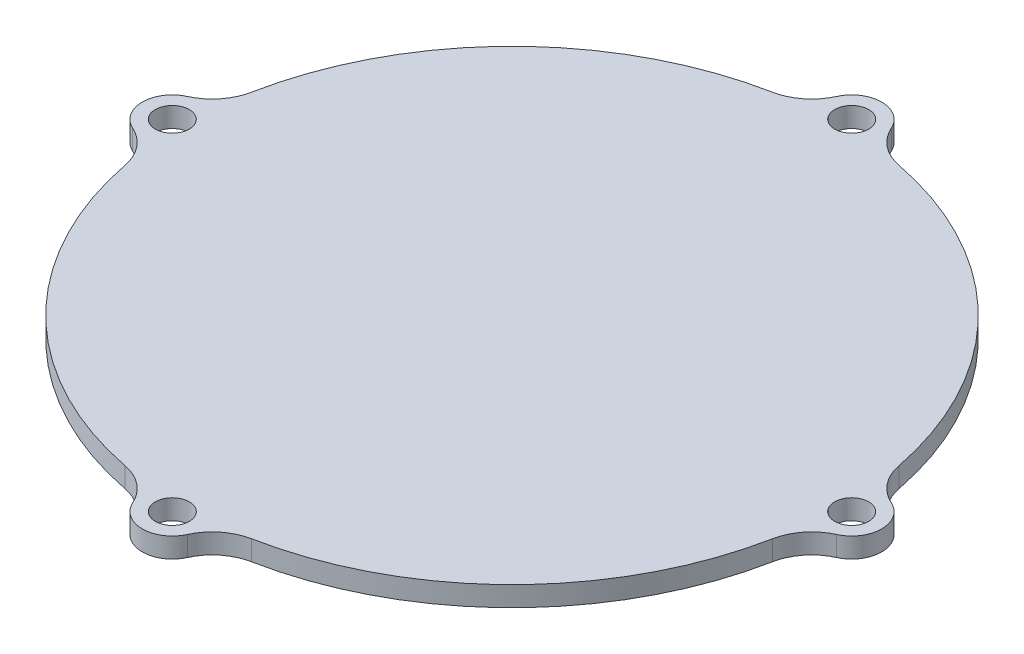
ISO-10303-21;
HEADER;
FILE_DESCRIPTION(('STEP AP214'),'2;1');
FILE_NAME('part.step','',(''),(''),'','','');
FILE_SCHEMA(('AUTOMOTIVE_DESIGN { 1 0 10303 214 1 1 1 1 }'));
ENDSEC;
DATA;
#1=APPLICATION_CONTEXT('core data for automotive mechanical design processes');
#2=APPLICATION_PROTOCOL_DEFINITION('international standard','automotive_design',2000,#1);
#3=PRODUCT_CONTEXT('',#1,'mechanical');
#4=PRODUCT('Part','Part','',(#3));
#5=PRODUCT_RELATED_PRODUCT_CATEGORY('part','',(#4));
#6=PRODUCT_DEFINITION_FORMATION('','',#4);
#7=PRODUCT_DEFINITION_CONTEXT('part definition',#1,'design');
#8=PRODUCT_DEFINITION('design','',#6,#7);
#9=PRODUCT_DEFINITION_SHAPE('','',#8);
#10=(LENGTH_UNIT() NAMED_UNIT(*) SI_UNIT(.MILLI.,.METRE.));
#11=(NAMED_UNIT(*) PLANE_ANGLE_UNIT() SI_UNIT($,.RADIAN.));
#12=(NAMED_UNIT(*) SI_UNIT($,.STERADIAN.) SOLID_ANGLE_UNIT());
#13=UNCERTAINTY_MEASURE_WITH_UNIT(LENGTH_MEASURE(1.E-05),#10,'distance_accuracy_value','');
#14=(GEOMETRIC_REPRESENTATION_CONTEXT(3) GLOBAL_UNCERTAINTY_ASSIGNED_CONTEXT((#13)) GLOBAL_UNIT_ASSIGNED_CONTEXT((#10,
#11,#12)) REPRESENTATION_CONTEXT('',''));
#15=CARTESIAN_POINT('',(0.,0.,0.));
#16=DIRECTION('',(0.,0.,1.));
#17=DIRECTION('',(1.,0.,0.));
#18=AXIS2_PLACEMENT_3D('',#15,#16,#17);
#19=CARTESIAN_POINT('',(0.,2.,0.));
#20=DIRECTION('',(0.,-1.,0.));
#21=DIRECTION('',(0.,0.,-1.));
#22=AXIS2_PLACEMENT_3D('',#19,#20,#21);
#23=CYLINDRICAL_SURFACE('',#22,33.);
#24=CARTESIAN_POINT('',(0.,0.,0.));
#25=DIRECTION('',(0.,1.,0.));
#26=DIRECTION('',(0.,0.,1.));
#27=AXIS2_PLACEMENT_3D('',#24,#25,#26);
#28=CIRCLE('',#27,33.);
#29=CARTESIAN_POINT('',(-6.33106875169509,0.,-32.3869969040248));
#30=VERTEX_POINT('',#29);
#31=CARTESIAN_POINT('',(-32.3869969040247,0.,-6.33106875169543));
#32=VERTEX_POINT('',#31);
#33=EDGE_CURVE('E164',#30,#32,#28,.T.);
#34=ORIENTED_EDGE('',*,*,#33,.T.);
#35=DIRECTION('',(0.,-1.,0.));
#36=VECTOR('',#35,1.);
#37=CARTESIAN_POINT('',(-32.3869969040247,2.,-6.33106875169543));
#38=LINE('',#37,#36);
#39=CARTESIAN_POINT('',(-32.3869969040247,2.,-6.33106875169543));
#40=VERTEX_POINT('',#39);
#41=EDGE_CURVE('E258',#32,#40,#38,.F.);
#42=ORIENTED_EDGE('',*,*,#41,.T.);
#43=CARTESIAN_POINT('',(0.,2.,0.));
#44=DIRECTION('',(0.,1.,0.));
#45=DIRECTION('',(0.,0.,1.));
#46=AXIS2_PLACEMENT_3D('',#43,#44,#45);
#47=CIRCLE('',#46,33.);
#48=CARTESIAN_POINT('',(-6.33106875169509,2.,-32.3869969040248));
#49=VERTEX_POINT('',#48);
#50=EDGE_CURVE('E166',#49,#40,#47,.T.);
#51=ORIENTED_EDGE('',*,*,#50,.F.);
#52=DIRECTION('',(0.,-1.,0.));
#53=VECTOR('',#52,1.);
#54=CARTESIAN_POINT('',(-6.3310687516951,2.,-32.3869969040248));
#55=LINE('',#54,#53);
#56=EDGE_CURVE('E156',#49,#30,#55,.T.);
#57=ORIENTED_EDGE('',*,*,#56,.T.);
#58=EDGE_LOOP('',(#34,#42,#51,#57));
#59=FACE_BOUND('',#58,.T.);
#60=ADVANCED_FACE('F39',(#59),#23,.T.);
#61=CARTESIAN_POINT('',(-32.3869969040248,2.,6.33106875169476));
#62=VERTEX_POINT('',#61);
#63=CARTESIAN_POINT('',(-6.33106875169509,2.,32.3869969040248));
#64=VERTEX_POINT('',#63);
#65=EDGE_CURVE('E195',#62,#64,#47,.T.);
#66=ORIENTED_EDGE('',*,*,#65,.F.);
#67=DIRECTION('',(0.,-1.,0.));
#68=VECTOR('',#67,1.);
#69=CARTESIAN_POINT('',(-32.3869969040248,2.,6.33106875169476));
#70=LINE('',#69,#68);
#71=CARTESIAN_POINT('',(-32.3869969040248,0.,6.33106875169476));
#72=VERTEX_POINT('',#71);
#73=EDGE_CURVE('E251',#62,#72,#70,.T.);
#74=ORIENTED_EDGE('',*,*,#73,.T.);
#75=CARTESIAN_POINT('',(-6.33106875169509,0.,32.3869969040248));
#76=VERTEX_POINT('',#75);
#77=EDGE_CURVE('E173',#72,#76,#28,.T.);
#78=ORIENTED_EDGE('',*,*,#77,.T.);
#79=DIRECTION('',(0.,-1.,0.));
#80=VECTOR('',#79,1.);
#81=CARTESIAN_POINT('',(-6.3310687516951,2.,32.3869969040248));
#82=LINE('',#81,#80);
#83=EDGE_CURVE('E240',#76,#64,#82,.F.);
#84=ORIENTED_EDGE('',*,*,#83,.T.);
#85=EDGE_LOOP('',(#66,#74,#78,#84));
#86=FACE_BOUND('',#85,.T.);
#87=ADVANCED_FACE('F287',(#86),#23,.T.);
#88=CARTESIAN_POINT('',(6.33106875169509,2.,32.3869969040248));
#89=VERTEX_POINT('',#88);
#90=CARTESIAN_POINT('',(32.3869969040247,2.,6.33106875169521));
#91=VERTEX_POINT('',#90);
#92=EDGE_CURVE('E176',#89,#91,#47,.T.);
#93=ORIENTED_EDGE('',*,*,#92,.F.);
#94=DIRECTION('',(0.,-1.,0.));
#95=VECTOR('',#94,1.);
#96=CARTESIAN_POINT('',(6.3310687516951,2.,32.3869969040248));
#97=LINE('',#96,#95);
#98=CARTESIAN_POINT('',(6.33106875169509,0.,32.3869969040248));
#99=VERTEX_POINT('',#98);
#100=EDGE_CURVE('E234',#89,#99,#97,.T.);
#101=ORIENTED_EDGE('',*,*,#100,.T.);
#102=CARTESIAN_POINT('',(32.3869969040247,0.,6.33106875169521));
#103=VERTEX_POINT('',#102);
#104=EDGE_CURVE('E178',#99,#103,#28,.T.);
#105=ORIENTED_EDGE('',*,*,#104,.T.);
#106=DIRECTION('',(0.,-1.,0.));
#107=VECTOR('',#106,1.);
#108=CARTESIAN_POINT('',(32.3869969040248,2.,6.33106875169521));
#109=LINE('',#108,#107);
#110=EDGE_CURVE('E217',#103,#91,#109,.F.);
#111=ORIENTED_EDGE('',*,*,#110,.T.);
#112=EDGE_LOOP('',(#93,#101,#105,#111));
#113=FACE_BOUND('',#112,.T.);
#114=ADVANCED_FACE('F222',(#113),#23,.T.);
#115=CARTESIAN_POINT('',(32.3869969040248,2.,-6.33106875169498));
#116=VERTEX_POINT('',#115);
#117=CARTESIAN_POINT('',(6.33106875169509,2.,-32.3869969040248));
#118=VERTEX_POINT('',#117);
#119=EDGE_CURVE('E172',#116,#118,#47,.T.);
#120=ORIENTED_EDGE('',*,*,#119,.F.);
#121=DIRECTION('',(0.,-1.,0.));
#122=VECTOR('',#121,1.);
#123=CARTESIAN_POINT('',(32.3869969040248,2.,-6.33106875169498));
#124=LINE('',#123,#122);
#125=CARTESIAN_POINT('',(32.3869969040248,0.,-6.33106875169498));
#126=VERTEX_POINT('',#125);
#127=EDGE_CURVE('E305',#116,#126,#124,.T.);
#128=ORIENTED_EDGE('',*,*,#127,.T.);
#129=CARTESIAN_POINT('',(6.33106875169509,0.,-32.3869969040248));
#130=VERTEX_POINT('',#129);
#131=EDGE_CURVE('E175',#126,#130,#28,.T.);
#132=ORIENTED_EDGE('',*,*,#131,.T.);
#133=DIRECTION('',(0.,-1.,0.));
#134=VECTOR('',#133,1.);
#135=CARTESIAN_POINT('',(6.3310687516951,2.,-32.3869969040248));
#136=LINE('',#135,#134);
#137=EDGE_CURVE('E168',#130,#118,#136,.F.);
#138=ORIENTED_EDGE('',*,*,#137,.T.);
#139=EDGE_LOOP('',(#120,#128,#132,#138));
#140=FACE_BOUND('',#139,.T.);
#141=ADVANCED_FACE('F289',(#140),#23,.T.);
#142=CARTESIAN_POINT('',(0.,2.,0.));
#143=DIRECTION('',(0.,1.,0.));
#144=DIRECTION('',(0.,0.,1.));
#145=AXIS2_PLACEMENT_3D('',#142,#143,#144);
#146=PLANE('',#145);
#147=CARTESIAN_POINT('',(0.,2.,34.));
#148=DIRECTION('',(0.,1.,0.));
#149=DIRECTION('',(0.,0.,1.));
#150=AXIS2_PLACEMENT_3D('',#147,#148,#149);
#151=CIRCLE('',#150,1.69999999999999);
#152=CARTESIAN_POINT('',(0.,2.,35.7));
#153=VERTEX_POINT('',#152);
#154=EDGE_CURVE('E384',#153,#153,#151,.T.);
#155=ORIENTED_EDGE('',*,*,#154,.F.);
#156=EDGE_LOOP('',(#155));
#157=FACE_BOUND('',#156,.T.);
#158=CARTESIAN_POINT('',(34.,2.,1.18710365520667E-13));
#159=DIRECTION('',(0.,1.,0.));
#160=DIRECTION('',(0.,0.,1.));
#161=AXIS2_PLACEMENT_3D('',#158,#159,#160);
#162=CIRCLE('',#161,1.69999999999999);
#163=CARTESIAN_POINT('',(34.,2.,1.7000000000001));
#164=VERTEX_POINT('',#163);
#165=EDGE_CURVE('E378',#164,#164,#162,.T.);
#166=ORIENTED_EDGE('',*,*,#165,.F.);
#167=EDGE_LOOP('',(#166));
#168=FACE_BOUND('',#167,.T.);
#169=CARTESIAN_POINT('',(0.,2.,-34.));
#170=DIRECTION('',(0.,1.,0.));
#171=DIRECTION('',(0.,0.,1.));
#172=AXIS2_PLACEMENT_3D('',#169,#170,#171);
#173=CIRCLE('',#172,1.69999999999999);
#174=CARTESIAN_POINT('',(0.,2.,-32.3));
#175=VERTEX_POINT('',#174);
#176=EDGE_CURVE('E372',#175,#175,#173,.T.);
#177=ORIENTED_EDGE('',*,*,#176,.F.);
#178=EDGE_LOOP('',(#177));
#179=FACE_BOUND('',#178,.T.);
#180=CARTESIAN_POINT('',(-34.,2.,-3.56131096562E-13));
#181=DIRECTION('',(0.,1.,0.));
#182=DIRECTION('',(0.,0.,1.));
#183=AXIS2_PLACEMENT_3D('',#180,#181,#182);
#184=CIRCLE('',#183,1.69999999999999);
#185=CARTESIAN_POINT('',(-34.,2.,1.69999999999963));
#186=VERTEX_POINT('',#185);
#187=EDGE_CURVE('E366',#186,#186,#184,.T.);
#188=ORIENTED_EDGE('',*,*,#187,.F.);
#189=EDGE_LOOP('',(#188));
#190=FACE_BOUND('',#189,.T.);
#191=ORIENTED_EDGE('',*,*,#50,.T.);
#192=CARTESIAN_POINT('',(-37.2941176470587,2.,-7.29032159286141));
#193=DIRECTION('',(0.,1.,0.));
#194=DIRECTION('',(0.,0.,1.));
#195=AXIS2_PLACEMENT_3D('',#192,#193,#194);
#196=CIRCLE('',#195,5.);
#197=CARTESIAN_POINT('',(-35.235294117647,2.,-2.73387059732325));
#198=VERTEX_POINT('',#197);
#199=EDGE_CURVE('E47',#40,#198,#196,.F.);
#200=ORIENTED_EDGE('',*,*,#199,.T.);
#201=CARTESIAN_POINT('',(-34.,2.,-3.56131096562E-13));
#202=DIRECTION('',(0.,1.,0.));
#203=DIRECTION('',(1.,0.,0.));
#204=AXIS2_PLACEMENT_3D('',#201,#202,#203);
#205=CIRCLE('',#204,3.);
#206=CARTESIAN_POINT('',(-35.2352941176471,2.,2.73387059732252));
#207=VERTEX_POINT('',#206);
#208=EDGE_CURVE('E265',#198,#207,#205,.T.);
#209=ORIENTED_EDGE('',*,*,#208,.T.);
#210=CARTESIAN_POINT('',(-37.2941176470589,2.,7.29032159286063));
#211=DIRECTION('',(0.,1.,0.));
#212=DIRECTION('',(0.,0.,1.));
#213=AXIS2_PLACEMENT_3D('',#210,#211,#212);
#214=CIRCLE('',#213,5.);
#215=EDGE_CURVE('E262',#207,#62,#214,.F.);
#216=ORIENTED_EDGE('',*,*,#215,.T.);
#217=ORIENTED_EDGE('',*,*,#65,.T.);
#218=CARTESIAN_POINT('',(-7.29032159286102,2.,37.2941176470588));
#219=DIRECTION('',(0.,1.,0.));
#220=DIRECTION('',(0.,0.,1.));
#221=AXIS2_PLACEMENT_3D('',#218,#219,#220);
#222=CIRCLE('',#221,5.);
#223=CARTESIAN_POINT('',(-2.73387059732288,2.,35.2352941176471));
#224=VERTEX_POINT('',#223);
#225=EDGE_CURVE('E246',#64,#224,#222,.F.);
#226=ORIENTED_EDGE('',*,*,#225,.T.);
#227=CARTESIAN_POINT('',(0.,2.,34.));
#228=DIRECTION('',(0.,1.,0.));
#229=DIRECTION('',(0.,0.,-1.));
#230=AXIS2_PLACEMENT_3D('',#227,#228,#229);
#231=CIRCLE('',#230,3.);
#232=CARTESIAN_POINT('',(2.73387059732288,2.,35.2352941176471));
#233=VERTEX_POINT('',#232);
#234=EDGE_CURVE('E357',#224,#233,#231,.T.);
#235=ORIENTED_EDGE('',*,*,#234,.T.);
#236=CARTESIAN_POINT('',(7.29032159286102,2.,37.2941176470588));
#237=DIRECTION('',(0.,1.,0.));
#238=DIRECTION('',(0.,0.,1.));
#239=AXIS2_PLACEMENT_3D('',#236,#237,#238);
#240=CIRCLE('',#239,5.);
#241=EDGE_CURVE('E207',#233,#89,#240,.F.);
#242=ORIENTED_EDGE('',*,*,#241,.T.);
#243=ORIENTED_EDGE('',*,*,#92,.T.);
#244=CARTESIAN_POINT('',(37.2941176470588,2.,7.29032159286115));
#245=DIRECTION('',(0.,1.,0.));
#246=DIRECTION('',(0.,0.,1.));
#247=AXIS2_PLACEMENT_3D('',#244,#245,#246);
#248=CIRCLE('',#247,5.);
#249=CARTESIAN_POINT('',(35.2352941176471,2.,2.73387059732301));
#250=VERTEX_POINT('',#249);
#251=EDGE_CURVE('E203',#91,#250,#248,.F.);
#252=ORIENTED_EDGE('',*,*,#251,.T.);
#253=CARTESIAN_POINT('',(34.,2.,1.18710365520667E-13));
#254=DIRECTION('',(0.,1.,0.));
#255=DIRECTION('',(-1.,0.,0.));
#256=AXIS2_PLACEMENT_3D('',#253,#254,#255);
#257=CIRCLE('',#256,3.);
#258=CARTESIAN_POINT('',(35.2352941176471,2.,-2.73387059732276));
#259=VERTEX_POINT('',#258);
#260=EDGE_CURVE('E193',#250,#259,#257,.T.);
#261=ORIENTED_EDGE('',*,*,#260,.T.);
#262=CARTESIAN_POINT('',(37.2941176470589,2.,-7.29032159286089));
#263=DIRECTION('',(0.,1.,0.));
#264=DIRECTION('',(0.,0.,1.));
#265=AXIS2_PLACEMENT_3D('',#262,#263,#264);
#266=CIRCLE('',#265,5.);
#267=EDGE_CURVE('E220',#259,#116,#266,.F.);
#268=ORIENTED_EDGE('',*,*,#267,.T.);
#269=ORIENTED_EDGE('',*,*,#119,.T.);
#270=CARTESIAN_POINT('',(7.29032159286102,2.,-37.2941176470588));
#271=DIRECTION('',(0.,1.,0.));
#272=DIRECTION('',(0.,0.,1.));
#273=AXIS2_PLACEMENT_3D('',#270,#271,#272);
#274=CIRCLE('',#273,5.);
#275=CARTESIAN_POINT('',(2.73387059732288,2.,-35.2352941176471));
#276=VERTEX_POINT('',#275);
#277=EDGE_CURVE('E314',#118,#276,#274,.F.);
#278=ORIENTED_EDGE('',*,*,#277,.T.);
#279=CARTESIAN_POINT('',(0.,2.,-34.));
#280=DIRECTION('',(0.,1.,0.));
#281=DIRECTION('',(0.,0.,1.));
#282=AXIS2_PLACEMENT_3D('',#279,#280,#281);
#283=CIRCLE('',#282,3.);
#284=CARTESIAN_POINT('',(-2.73387059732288,2.,-35.2352941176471));
#285=VERTEX_POINT('',#284);
#286=EDGE_CURVE('E186',#276,#285,#283,.T.);
#287=ORIENTED_EDGE('',*,*,#286,.T.);
#288=CARTESIAN_POINT('',(-7.29032159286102,2.,-37.2941176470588));
#289=DIRECTION('',(0.,1.,0.));
#290=DIRECTION('',(0.,0.,1.));
#291=AXIS2_PLACEMENT_3D('',#288,#289,#290);
#292=CIRCLE('',#291,5.);
#293=EDGE_CURVE('E160',#285,#49,#292,.F.);
#294=ORIENTED_EDGE('',*,*,#293,.T.);
#295=EDGE_LOOP('',(#191,#200,#209,#216,#217,#226,#235,#242,#243,#252,#261,#268,#269,#278,#287,#294));
#296=FACE_BOUND('',#295,.T.);
#297=ADVANCED_FACE('F201',(#157,#168,#179,#190,#296),#146,.T.);
#298=CARTESIAN_POINT('',(0.,0.,0.));
#299=DIRECTION('',(0.,1.,0.));
#300=DIRECTION('',(0.,0.,1.));
#301=AXIS2_PLACEMENT_3D('',#298,#299,#300);
#302=PLANE('',#301);
#303=CARTESIAN_POINT('',(0.,0.,34.));
#304=DIRECTION('',(0.,1.,0.));
#305=DIRECTION('',(0.,0.,1.));
#306=AXIS2_PLACEMENT_3D('',#303,#304,#305);
#307=CIRCLE('',#306,1.7);
#308=CARTESIAN_POINT('',(0.,0.,35.7));
#309=VERTEX_POINT('',#308);
#310=EDGE_CURVE('E381',#309,#309,#307,.T.);
#311=ORIENTED_EDGE('',*,*,#310,.T.);
#312=EDGE_LOOP('',(#311));
#313=FACE_BOUND('',#312,.T.);
#314=CARTESIAN_POINT('',(34.,0.,1.18710365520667E-13));
#315=DIRECTION('',(0.,1.,0.));
#316=DIRECTION('',(0.,0.,1.));
#317=AXIS2_PLACEMENT_3D('',#314,#315,#316);
#318=CIRCLE('',#317,1.7);
#319=CARTESIAN_POINT('',(34.,0.,1.70000000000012));
#320=VERTEX_POINT('',#319);
#321=EDGE_CURVE('E375',#320,#320,#318,.T.);
#322=ORIENTED_EDGE('',*,*,#321,.T.);
#323=EDGE_LOOP('',(#322));
#324=FACE_BOUND('',#323,.T.);
#325=CARTESIAN_POINT('',(0.,0.,-34.));
#326=DIRECTION('',(0.,1.,0.));
#327=DIRECTION('',(0.,0.,1.));
#328=AXIS2_PLACEMENT_3D('',#325,#326,#327);
#329=CIRCLE('',#328,1.7);
#330=CARTESIAN_POINT('',(0.,0.,-32.3));
#331=VERTEX_POINT('',#330);
#332=EDGE_CURVE('E369',#331,#331,#329,.T.);
#333=ORIENTED_EDGE('',*,*,#332,.T.);
#334=EDGE_LOOP('',(#333));
#335=FACE_BOUND('',#334,.T.);
#336=CARTESIAN_POINT('',(-34.,0.,-3.56131096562E-13));
#337=DIRECTION('',(0.,1.,0.));
#338=DIRECTION('',(0.,0.,1.));
#339=AXIS2_PLACEMENT_3D('',#336,#337,#338);
#340=CIRCLE('',#339,1.7);
#341=CARTESIAN_POINT('',(-34.,0.,1.69999999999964));
#342=VERTEX_POINT('',#341);
#343=EDGE_CURVE('E272',#342,#342,#340,.T.);
#344=ORIENTED_EDGE('',*,*,#343,.T.);
#345=EDGE_LOOP('',(#344));
#346=FACE_BOUND('',#345,.T.);
#347=ORIENTED_EDGE('',*,*,#77,.F.);
#348=CARTESIAN_POINT('',(-37.2941176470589,0.,7.29032159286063));
#349=DIRECTION('',(0.,1.,0.));
#350=DIRECTION('',(0.,0.,1.));
#351=AXIS2_PLACEMENT_3D('',#348,#349,#350);
#352=CIRCLE('',#351,5.);
#353=CARTESIAN_POINT('',(-35.2352941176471,0.,2.73387059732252));
#354=VERTEX_POINT('',#353);
#355=EDGE_CURVE('E260',#72,#354,#352,.T.);
#356=ORIENTED_EDGE('',*,*,#355,.T.);
#357=CARTESIAN_POINT('',(-34.,0.,-3.56131096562E-13));
#358=DIRECTION('',(0.,1.,0.));
#359=DIRECTION('',(1.,0.,0.));
#360=AXIS2_PLACEMENT_3D('',#357,#358,#359);
#361=CIRCLE('',#360,3.);
#362=CARTESIAN_POINT('',(-35.235294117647,0.,-2.73387059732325));
#363=VERTEX_POINT('',#362);
#364=EDGE_CURVE('E271',#363,#354,#361,.T.);
#365=ORIENTED_EDGE('',*,*,#364,.F.);
#366=CARTESIAN_POINT('',(-37.2941176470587,0.,-7.29032159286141));
#367=DIRECTION('',(0.,1.,0.));
#368=DIRECTION('',(0.,0.,1.));
#369=AXIS2_PLACEMENT_3D('',#366,#367,#368);
#370=CIRCLE('',#369,5.);
#371=EDGE_CURVE('E11',#363,#32,#370,.T.);
#372=ORIENTED_EDGE('',*,*,#371,.T.);
#373=ORIENTED_EDGE('',*,*,#33,.F.);
#374=CARTESIAN_POINT('',(-7.29032159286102,0.,-37.2941176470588));
#375=DIRECTION('',(0.,1.,0.));
#376=DIRECTION('',(0.,0.,1.));
#377=AXIS2_PLACEMENT_3D('',#374,#375,#376);
#378=CIRCLE('',#377,5.);
#379=CARTESIAN_POINT('',(-2.73387059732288,0.,-35.2352941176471));
#380=VERTEX_POINT('',#379);
#381=EDGE_CURVE('E152',#30,#380,#378,.T.);
#382=ORIENTED_EDGE('',*,*,#381,.T.);
#383=CARTESIAN_POINT('',(0.,0.,-34.));
#384=DIRECTION('',(0.,1.,0.));
#385=DIRECTION('',(0.,0.,1.));
#386=AXIS2_PLACEMENT_3D('',#383,#384,#385);
#387=CIRCLE('',#386,3.);
#388=CARTESIAN_POINT('',(2.73387059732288,0.,-35.2352941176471));
#389=VERTEX_POINT('',#388);
#390=EDGE_CURVE('E180',#389,#380,#387,.T.);
#391=ORIENTED_EDGE('',*,*,#390,.F.);
#392=CARTESIAN_POINT('',(7.29032159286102,0.,-37.2941176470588));
#393=DIRECTION('',(0.,1.,0.));
#394=DIRECTION('',(0.,0.,1.));
#395=AXIS2_PLACEMENT_3D('',#392,#393,#394);
#396=CIRCLE('',#395,5.);
#397=EDGE_CURVE('E312',#389,#130,#396,.T.);
#398=ORIENTED_EDGE('',*,*,#397,.T.);
#399=ORIENTED_EDGE('',*,*,#131,.F.);
#400=CARTESIAN_POINT('',(37.2941176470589,0.,-7.29032159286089));
#401=DIRECTION('',(0.,1.,0.));
#402=DIRECTION('',(0.,0.,1.));
#403=AXIS2_PLACEMENT_3D('',#400,#401,#402);
#404=CIRCLE('',#403,5.);
#405=CARTESIAN_POINT('',(35.2352941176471,0.,-2.73387059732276));
#406=VERTEX_POINT('',#405);
#407=EDGE_CURVE('E225',#126,#406,#404,.T.);
#408=ORIENTED_EDGE('',*,*,#407,.T.);
#409=CARTESIAN_POINT('',(34.,0.,1.18710365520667E-13));
#410=DIRECTION('',(0.,1.,0.));
#411=DIRECTION('',(-1.,0.,0.));
#412=AXIS2_PLACEMENT_3D('',#409,#410,#411);
#413=CIRCLE('',#412,3.);
#414=CARTESIAN_POINT('',(35.2352941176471,0.,2.73387059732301));
#415=VERTEX_POINT('',#414);
#416=EDGE_CURVE('E190',#415,#406,#413,.T.);
#417=ORIENTED_EDGE('',*,*,#416,.F.);
#418=CARTESIAN_POINT('',(37.2941176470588,0.,7.29032159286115));
#419=DIRECTION('',(0.,1.,0.));
#420=DIRECTION('',(0.,0.,1.));
#421=AXIS2_PLACEMENT_3D('',#418,#419,#420);
#422=CIRCLE('',#421,5.);
#423=EDGE_CURVE('E219',#415,#103,#422,.T.);
#424=ORIENTED_EDGE('',*,*,#423,.T.);
#425=ORIENTED_EDGE('',*,*,#104,.F.);
#426=CARTESIAN_POINT('',(7.29032159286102,0.,37.2941176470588));
#427=DIRECTION('',(0.,1.,0.));
#428=DIRECTION('',(0.,0.,1.));
#429=AXIS2_PLACEMENT_3D('',#426,#427,#428);
#430=CIRCLE('',#429,5.);
#431=CARTESIAN_POINT('',(2.73387059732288,0.,35.2352941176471));
#432=VERTEX_POINT('',#431);
#433=EDGE_CURVE('E243',#99,#432,#430,.T.);
#434=ORIENTED_EDGE('',*,*,#433,.T.);
#435=CARTESIAN_POINT('',(0.,0.,34.));
#436=DIRECTION('',(0.,1.,0.));
#437=DIRECTION('',(0.,0.,-1.));
#438=AXIS2_PLACEMENT_3D('',#435,#436,#437);
#439=CIRCLE('',#438,3.);
#440=CARTESIAN_POINT('',(-2.73387059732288,0.,35.2352941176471));
#441=VERTEX_POINT('',#440);
#442=EDGE_CURVE('E354',#441,#432,#439,.T.);
#443=ORIENTED_EDGE('',*,*,#442,.F.);
#444=CARTESIAN_POINT('',(-7.29032159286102,0.,37.2941176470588));
#445=DIRECTION('',(0.,1.,0.));
#446=DIRECTION('',(0.,0.,1.));
#447=AXIS2_PLACEMENT_3D('',#444,#445,#446);
#448=CIRCLE('',#447,5.);
#449=EDGE_CURVE('E248',#441,#76,#448,.T.);
#450=ORIENTED_EDGE('',*,*,#449,.T.);
#451=EDGE_LOOP('',(#347,#356,#365,#372,#373,#382,#391,#398,#399,#408,#417,#424,#425,#434,#443,#450));
#452=FACE_BOUND('',#451,.T.);
#453=ADVANCED_FACE('F171',(#313,#324,#335,#346,#452),#302,.F.);
#454=CARTESIAN_POINT('',(0.,0.,-34.));
#455=DIRECTION('',(0.,1.,0.));
#456=DIRECTION('',(0.,0.,1.));
#457=AXIS2_PLACEMENT_3D('',#454,#455,#456);
#458=CYLINDRICAL_SURFACE('',#457,3.);
#459=ORIENTED_EDGE('',*,*,#390,.T.);
#460=DIRECTION('',(0.,1.,0.));
#461=VECTOR('',#460,1.);
#462=CARTESIAN_POINT('',(-2.73387059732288,0.,-35.2352941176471));
#463=LINE('',#462,#461);
#464=EDGE_CURVE('E157',#380,#285,#463,.T.);
#465=ORIENTED_EDGE('',*,*,#464,.T.);
#466=ORIENTED_EDGE('',*,*,#286,.F.);
#467=DIRECTION('',(0.,1.,0.));
#468=VECTOR('',#467,1.);
#469=CARTESIAN_POINT('',(2.73387059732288,0.,-35.2352941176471));
#470=LINE('',#469,#468);
#471=EDGE_CURVE('E167',#276,#389,#470,.F.);
#472=ORIENTED_EDGE('',*,*,#471,.T.);
#473=EDGE_LOOP('',(#459,#465,#466,#472));
#474=FACE_BOUND('',#473,.T.);
#475=ADVANCED_FACE('F322',(#474),#458,.T.);
#476=CARTESIAN_POINT('',(-7.29032159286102,0.,-37.2941176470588));
#477=DIRECTION('',(0.,1.,0.));
#478=DIRECTION('',(0.,0.,1.));
#479=AXIS2_PLACEMENT_3D('',#476,#477,#478);
#480=CYLINDRICAL_SURFACE('',#479,5.);
#481=ORIENTED_EDGE('',*,*,#293,.F.);
#482=ORIENTED_EDGE('',*,*,#464,.F.);
#483=ORIENTED_EDGE('',*,*,#381,.F.);
#484=ORIENTED_EDGE('',*,*,#56,.F.);
#485=EDGE_LOOP('',(#481,#482,#483,#484));
#486=FACE_BOUND('',#485,.T.);
#487=ADVANCED_FACE('F155',(#486),#480,.F.);
#488=CARTESIAN_POINT('',(7.29032159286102,0.,-37.2941176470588));
#489=DIRECTION('',(0.,-1.,0.));
#490=DIRECTION('',(0.,0.,-1.));
#491=AXIS2_PLACEMENT_3D('',#488,#489,#490);
#492=CYLINDRICAL_SURFACE('',#491,5.);
#493=ORIENTED_EDGE('',*,*,#397,.F.);
#494=ORIENTED_EDGE('',*,*,#471,.F.);
#495=ORIENTED_EDGE('',*,*,#277,.F.);
#496=ORIENTED_EDGE('',*,*,#137,.F.);
#497=EDGE_LOOP('',(#493,#494,#495,#496));
#498=FACE_BOUND('',#497,.T.);
#499=ADVANCED_FACE('F325',(#498),#492,.F.);
#500=CARTESIAN_POINT('',(34.,0.,1.18710365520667E-13));
#501=DIRECTION('',(0.,1.,0.));
#502=DIRECTION('',(0.,0.,1.));
#503=AXIS2_PLACEMENT_3D('',#500,#501,#502);
#504=CYLINDRICAL_SURFACE('',#503,3.);
#505=ORIENTED_EDGE('',*,*,#416,.T.);
#506=DIRECTION('',(0.,1.,0.));
#507=VECTOR('',#506,1.);
#508=CARTESIAN_POINT('',(35.2352941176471,0.,-2.73387059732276));
#509=LINE('',#508,#507);
#510=EDGE_CURVE('E226',#406,#259,#509,.T.);
#511=ORIENTED_EDGE('',*,*,#510,.T.);
#512=ORIENTED_EDGE('',*,*,#260,.F.);
#513=DIRECTION('',(0.,1.,0.));
#514=VECTOR('',#513,1.);
#515=CARTESIAN_POINT('',(35.2352941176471,0.,2.73387059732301));
#516=LINE('',#515,#514);
#517=EDGE_CURVE('E218',#250,#415,#516,.F.);
#518=ORIENTED_EDGE('',*,*,#517,.T.);
#519=EDGE_LOOP('',(#505,#511,#512,#518));
#520=FACE_BOUND('',#519,.T.);
#521=ADVANCED_FACE('F327',(#520),#504,.T.);
#522=CARTESIAN_POINT('',(0.,0.,34.));
#523=DIRECTION('',(0.,1.,0.));
#524=DIRECTION('',(0.,0.,1.));
#525=AXIS2_PLACEMENT_3D('',#522,#523,#524);
#526=CYLINDRICAL_SURFACE('',#525,3.);
#527=ORIENTED_EDGE('',*,*,#442,.T.);
#528=DIRECTION('',(0.,1.,0.));
#529=VECTOR('',#528,1.);
#530=CARTESIAN_POINT('',(2.73387059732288,0.,35.2352941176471));
#531=LINE('',#530,#529);
#532=EDGE_CURVE('E238',#432,#233,#531,.T.);
#533=ORIENTED_EDGE('',*,*,#532,.T.);
#534=ORIENTED_EDGE('',*,*,#234,.F.);
#535=DIRECTION('',(0.,1.,0.));
#536=VECTOR('',#535,1.);
#537=CARTESIAN_POINT('',(-2.73387059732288,0.,35.2352941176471));
#538=LINE('',#537,#536);
#539=EDGE_CURVE('E236',#224,#441,#538,.F.);
#540=ORIENTED_EDGE('',*,*,#539,.T.);
#541=EDGE_LOOP('',(#527,#533,#534,#540));
#542=FACE_BOUND('',#541,.T.);
#543=ADVANCED_FACE('F333',(#542),#526,.T.);
#544=CARTESIAN_POINT('',(-34.,0.,-3.56131096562E-13));
#545=DIRECTION('',(0.,1.,0.));
#546=DIRECTION('',(0.,0.,1.));
#547=AXIS2_PLACEMENT_3D('',#544,#545,#546);
#548=CYLINDRICAL_SURFACE('',#547,3.);
#549=ORIENTED_EDGE('',*,*,#364,.T.);
#550=DIRECTION('',(0.,1.,0.));
#551=VECTOR('',#550,1.);
#552=CARTESIAN_POINT('',(-35.2352941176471,0.,2.73387059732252));
#553=LINE('',#552,#551);
#554=EDGE_CURVE('E256',#354,#207,#553,.T.);
#555=ORIENTED_EDGE('',*,*,#554,.T.);
#556=ORIENTED_EDGE('',*,*,#208,.F.);
#557=DIRECTION('',(0.,1.,0.));
#558=VECTOR('',#557,1.);
#559=CARTESIAN_POINT('',(-35.235294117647,0.,-2.73387059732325));
#560=LINE('',#559,#558);
#561=EDGE_CURVE('E254',#198,#363,#560,.F.);
#562=ORIENTED_EDGE('',*,*,#561,.T.);
#563=EDGE_LOOP('',(#549,#555,#556,#562));
#564=FACE_BOUND('',#563,.T.);
#565=ADVANCED_FACE('F269',(#564),#548,.T.);
#566=CARTESIAN_POINT('',(37.2941176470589,0.,-7.29032159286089));
#567=DIRECTION('',(0.,1.,0.));
#568=DIRECTION('',(0.,0.,1.));
#569=AXIS2_PLACEMENT_3D('',#566,#567,#568);
#570=CYLINDRICAL_SURFACE('',#569,5.);
#571=ORIENTED_EDGE('',*,*,#267,.F.);
#572=ORIENTED_EDGE('',*,*,#510,.F.);
#573=ORIENTED_EDGE('',*,*,#407,.F.);
#574=ORIENTED_EDGE('',*,*,#127,.F.);
#575=EDGE_LOOP('',(#571,#572,#573,#574));
#576=FACE_BOUND('',#575,.T.);
#577=ADVANCED_FACE('F310',(#576),#570,.F.);
#578=CARTESIAN_POINT('',(37.2941176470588,0.,7.29032159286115));
#579=DIRECTION('',(0.,-1.,0.));
#580=DIRECTION('',(0.,0.,-1.));
#581=AXIS2_PLACEMENT_3D('',#578,#579,#580);
#582=CYLINDRICAL_SURFACE('',#581,5.);
#583=ORIENTED_EDGE('',*,*,#423,.F.);
#584=ORIENTED_EDGE('',*,*,#517,.F.);
#585=ORIENTED_EDGE('',*,*,#251,.F.);
#586=ORIENTED_EDGE('',*,*,#110,.F.);
#587=EDGE_LOOP('',(#583,#584,#585,#586));
#588=FACE_BOUND('',#587,.T.);
#589=ADVANCED_FACE('F216',(#588),#582,.F.);
#590=CARTESIAN_POINT('',(7.29032159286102,0.,37.2941176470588));
#591=DIRECTION('',(0.,1.,0.));
#592=DIRECTION('',(0.,0.,1.));
#593=AXIS2_PLACEMENT_3D('',#590,#591,#592);
#594=CYLINDRICAL_SURFACE('',#593,5.);
#595=ORIENTED_EDGE('',*,*,#241,.F.);
#596=ORIENTED_EDGE('',*,*,#532,.F.);
#597=ORIENTED_EDGE('',*,*,#433,.F.);
#598=ORIENTED_EDGE('',*,*,#100,.F.);
#599=EDGE_LOOP('',(#595,#596,#597,#598));
#600=FACE_BOUND('',#599,.T.);
#601=ADVANCED_FACE('F341',(#600),#594,.F.);
#602=CARTESIAN_POINT('',(-7.29032159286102,0.,37.2941176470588));
#603=DIRECTION('',(0.,-1.,0.));
#604=DIRECTION('',(0.,0.,-1.));
#605=AXIS2_PLACEMENT_3D('',#602,#603,#604);
#606=CYLINDRICAL_SURFACE('',#605,5.);
#607=ORIENTED_EDGE('',*,*,#449,.F.);
#608=ORIENTED_EDGE('',*,*,#539,.F.);
#609=ORIENTED_EDGE('',*,*,#225,.F.);
#610=ORIENTED_EDGE('',*,*,#83,.F.);
#611=EDGE_LOOP('',(#607,#608,#609,#610));
#612=FACE_BOUND('',#611,.T.);
#613=ADVANCED_FACE('F284',(#612),#606,.F.);
#614=CARTESIAN_POINT('',(-37.2941176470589,0.,7.29032159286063));
#615=DIRECTION('',(0.,1.,0.));
#616=DIRECTION('',(0.,0.,1.));
#617=AXIS2_PLACEMENT_3D('',#614,#615,#616);
#618=CYLINDRICAL_SURFACE('',#617,5.);
#619=ORIENTED_EDGE('',*,*,#215,.F.);
#620=ORIENTED_EDGE('',*,*,#554,.F.);
#621=ORIENTED_EDGE('',*,*,#355,.F.);
#622=ORIENTED_EDGE('',*,*,#73,.F.);
#623=EDGE_LOOP('',(#619,#620,#621,#622));
#624=FACE_BOUND('',#623,.T.);
#625=ADVANCED_FACE('F276',(#624),#618,.F.);
#626=CARTESIAN_POINT('',(-37.2941176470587,0.,-7.29032159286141));
#627=DIRECTION('',(0.,-1.,0.));
#628=DIRECTION('',(0.,0.,-1.));
#629=AXIS2_PLACEMENT_3D('',#626,#627,#628);
#630=CYLINDRICAL_SURFACE('',#629,5.);
#631=ORIENTED_EDGE('',*,*,#371,.F.);
#632=ORIENTED_EDGE('',*,*,#561,.F.);
#633=ORIENTED_EDGE('',*,*,#199,.F.);
#634=ORIENTED_EDGE('',*,*,#41,.F.);
#635=EDGE_LOOP('',(#631,#632,#633,#634));
#636=FACE_BOUND('',#635,.T.);
#637=ADVANCED_FACE('F41',(#636),#630,.F.);
#638=CARTESIAN_POINT('',(-34.,2.,-3.56131096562E-13));
#639=DIRECTION('',(0.,1.,0.));
#640=DIRECTION('',(0.,0.,1.));
#641=AXIS2_PLACEMENT_3D('',#638,#639,#640);
#642=CYLINDRICAL_SURFACE('',#641,1.69999999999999);
#643=ORIENTED_EDGE('',*,*,#343,.F.);
#644=EDGE_LOOP('',(#643));
#645=FACE_BOUND('',#644,.T.);
#646=ORIENTED_EDGE('',*,*,#187,.T.);
#647=EDGE_LOOP('',(#646));
#648=FACE_BOUND('',#647,.T.);
#649=ADVANCED_FACE('F275',(#645,#648),#642,.F.);
#650=CARTESIAN_POINT('',(0.,2.,-34.));
#651=DIRECTION('',(0.,1.,0.));
#652=DIRECTION('',(0.,0.,1.));
#653=AXIS2_PLACEMENT_3D('',#650,#651,#652);
#654=CYLINDRICAL_SURFACE('',#653,1.69999999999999);
#655=ORIENTED_EDGE('',*,*,#332,.F.);
#656=EDGE_LOOP('',(#655));
#657=FACE_BOUND('',#656,.T.);
#658=ORIENTED_EDGE('',*,*,#176,.T.);
#659=EDGE_LOOP('',(#658));
#660=FACE_BOUND('',#659,.T.);
#661=ADVANCED_FACE('F281',(#657,#660),#654,.F.);
#662=CARTESIAN_POINT('',(34.,2.,1.18710365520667E-13));
#663=DIRECTION('',(0.,1.,0.));
#664=DIRECTION('',(0.,0.,1.));
#665=AXIS2_PLACEMENT_3D('',#662,#663,#664);
#666=CYLINDRICAL_SURFACE('',#665,1.69999999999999);
#667=ORIENTED_EDGE('',*,*,#321,.F.);
#668=EDGE_LOOP('',(#667));
#669=FACE_BOUND('',#668,.T.);
#670=ORIENTED_EDGE('',*,*,#165,.T.);
#671=EDGE_LOOP('',(#670));
#672=FACE_BOUND('',#671,.T.);
#673=ADVANCED_FACE('F398',(#669,#672),#666,.F.);
#674=CARTESIAN_POINT('',(0.,2.,34.));
#675=DIRECTION('',(0.,1.,0.));
#676=DIRECTION('',(0.,0.,1.));
#677=AXIS2_PLACEMENT_3D('',#674,#675,#676);
#678=CYLINDRICAL_SURFACE('',#677,1.69999999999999);
#679=ORIENTED_EDGE('',*,*,#310,.F.);
#680=EDGE_LOOP('',(#679));
#681=FACE_BOUND('',#680,.T.);
#682=ORIENTED_EDGE('',*,*,#154,.T.);
#683=EDGE_LOOP('',(#682));
#684=FACE_BOUND('',#683,.T.);
#685=ADVANCED_FACE('F388',(#681,#684),#678,.F.);
#686=CLOSED_SHELL('',(#60,#87,#114,#141,#297,#453,#475,#487,#499,#521,#543,#565,#577,#589,#601,
#613,#625,#637,#649,#661,#673,#685));
#687=MANIFOLD_SOLID_BREP('B2',#686);
#688=ADVANCED_BREP_SHAPE_REPRESENTATION('',(#18,#687),#14);
#689=SHAPE_DEFINITION_REPRESENTATION(#9,#688);
ENDSEC;
END-ISO-10303-21;
